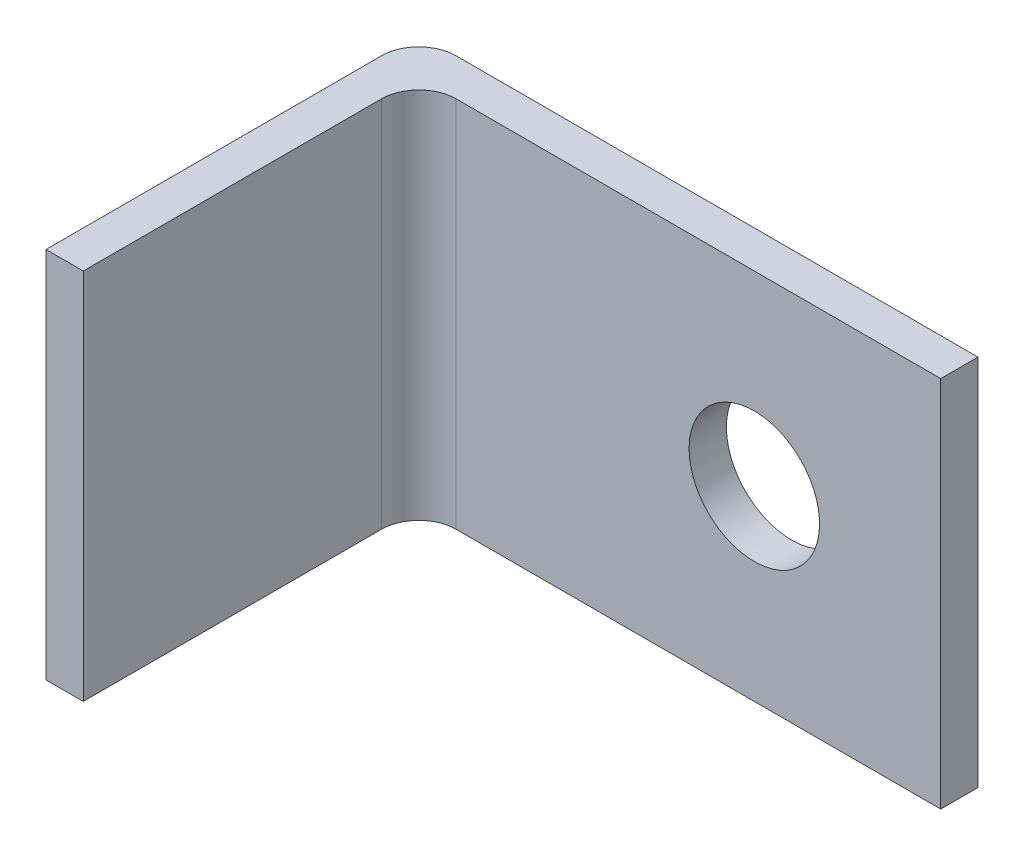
from build123d import *

# Parameters (mm, degrees)
EXTRUDE1_DEPTH     = 10
SKETCH2_R          = 1.75
CUT_EXTRUDE1_DEPTH = 10
FILLET1_R          = 1
FILLET2_R          = 1


with BuildPart() as part:
    # Sketch1 → Extrude1 (new body)
    with BuildSketch(Plane(origin=(0, 0, 0), x_dir=(1, 0, 0), z_dir=(0, 1, 0))):
        Polygon((0, 0), (0, 10), (15, 10), (15, 9), (1, 9), (1, 0), align=None)
    extrude(amount=EXTRUDE1_DEPTH)

    # Sketch2 → Cut-Extrude1 (cut)
    with BuildSketch(Plane(origin=(0, 0, -10), x_dir=(-1, 0, 0), z_dir=(0, 0, -1))):
        with Locations((-10, 5)):
            Circle(SKETCH2_R)
    extrude(amount=-CUT_EXTRUDE1_DEPTH, mode=Mode.SUBTRACT)

    # Fillet1
    fillet1_edges = [part.edges().sort_by_distance(p)[0] for p in [
        (0, 5, -10),
    ]]
    fillet(fillet1_edges, radius=FILLET1_R)

    # Fillet2
    fillet2_edges = [part.edges().sort_by_distance(p)[0] for p in [
        (1, 5, -9),
    ]]
    fillet(fillet2_edges, radius=FILLET2_R)


solid = part.part
